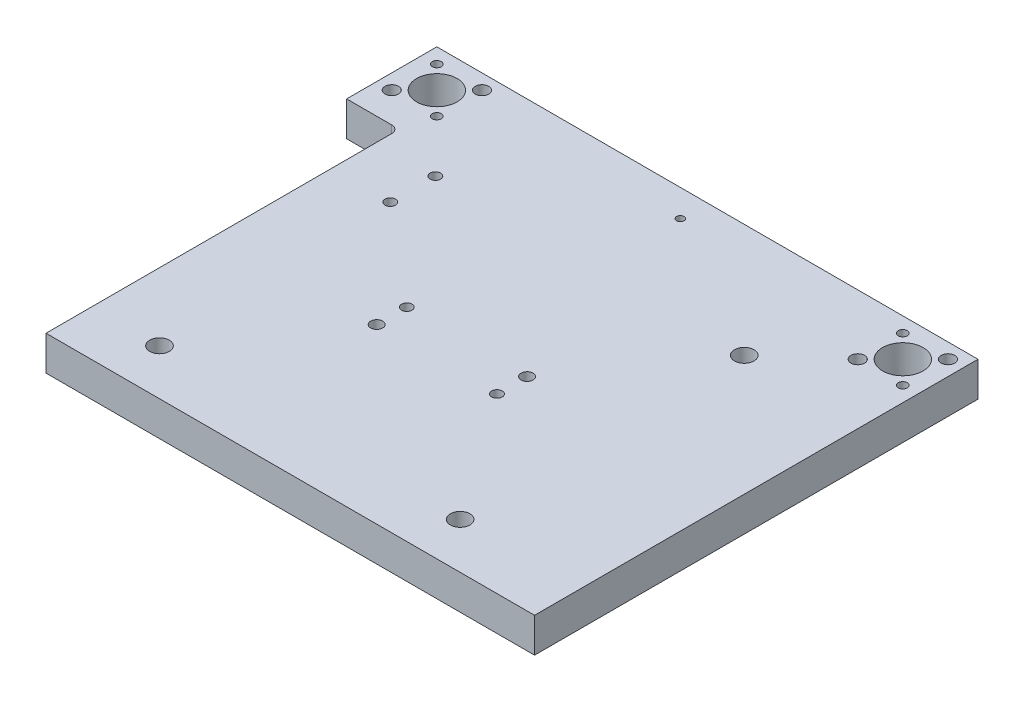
ISO-10303-21;
HEADER;
FILE_DESCRIPTION(('STEP AP214'),'2;1');
FILE_NAME('part.step','',(''),(''),'','','');
FILE_SCHEMA(('AUTOMOTIVE_DESIGN { 1 0 10303 214 1 1 1 1 }'));
ENDSEC;
DATA;
#1=APPLICATION_CONTEXT('core data for automotive mechanical design processes');
#2=APPLICATION_PROTOCOL_DEFINITION('international standard','automotive_design',2000,#1);
#3=PRODUCT_CONTEXT('',#1,'mechanical');
#4=PRODUCT('Part','Part','',(#3));
#5=PRODUCT_RELATED_PRODUCT_CATEGORY('part','',(#4));
#6=PRODUCT_DEFINITION_FORMATION('','',#4);
#7=PRODUCT_DEFINITION_CONTEXT('part definition',#1,'design');
#8=PRODUCT_DEFINITION('design','',#6,#7);
#9=PRODUCT_DEFINITION_SHAPE('','',#8);
#10=(LENGTH_UNIT() NAMED_UNIT(*) SI_UNIT(.MILLI.,.METRE.));
#11=(NAMED_UNIT(*) PLANE_ANGLE_UNIT() SI_UNIT($,.RADIAN.));
#12=(NAMED_UNIT(*) SI_UNIT($,.STERADIAN.) SOLID_ANGLE_UNIT());
#13=UNCERTAINTY_MEASURE_WITH_UNIT(LENGTH_MEASURE(1.E-05),#10,'distance_accuracy_value','');
#14=(GEOMETRIC_REPRESENTATION_CONTEXT(3) GLOBAL_UNCERTAINTY_ASSIGNED_CONTEXT((#13)) GLOBAL_UNIT_ASSIGNED_CONTEXT((#10,
#11,#12)) REPRESENTATION_CONTEXT('',''));
#15=CARTESIAN_POINT('',(0.,0.,0.));
#16=DIRECTION('',(0.,0.,1.));
#17=DIRECTION('',(1.,0.,0.));
#18=AXIS2_PLACEMENT_3D('',#15,#16,#17);
#19=CARTESIAN_POINT('',(-0.000732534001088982,213.58,26.9999931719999));
#20=DIRECTION('',(0.,1.,0.));
#21=DIRECTION('',(0.,0.,1.));
#22=AXIS2_PLACEMENT_3D('',#19,#20,#21);
#23=CYLINDRICAL_SURFACE('',#22,2.5);
#24=CARTESIAN_POINT('',(-0.000732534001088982,230.58,26.9999931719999));
#25=DIRECTION('',(0.,1.,0.));
#26=DIRECTION('',(0.,0.,1.));
#27=AXIS2_PLACEMENT_3D('',#24,#25,#26);
#28=CIRCLE('',#27,2.5);
#29=CARTESIAN_POINT('',(-0.000732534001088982,230.58,29.4999931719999));
#30=VERTEX_POINT('',#29);
#31=EDGE_CURVE('E283',#30,#30,#28,.T.);
#32=ORIENTED_EDGE('',*,*,#31,.T.);
#33=EDGE_LOOP('',(#32));
#34=FACE_BOUND('',#33,.T.);
#35=CARTESIAN_POINT('',(-0.000732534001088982,213.58,26.9999931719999));
#36=DIRECTION('',(0.,1.,0.));
#37=DIRECTION('',(0.,0.,1.));
#38=AXIS2_PLACEMENT_3D('',#35,#36,#37);
#39=CIRCLE('',#38,2.5);
#40=CARTESIAN_POINT('',(-0.000732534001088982,213.58,29.4999931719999));
#41=VERTEX_POINT('',#40);
#42=EDGE_CURVE('E19',#41,#41,#39,.F.);
#43=ORIENTED_EDGE('',*,*,#42,.T.);
#44=EDGE_LOOP('',(#43));
#45=FACE_BOUND('',#44,.T.);
#46=ADVANCED_FACE('F15',(#34,#45),#23,.F.);
#47=CARTESIAN_POINT('',(-0.000732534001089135,213.58,26.9999931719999));
#48=DIRECTION('',(0.,1.,0.));
#49=DIRECTION('',(0.,0.,1.));
#50=AXIS2_PLACEMENT_3D('',#47,#48,#49);
#51=PLANE('',#50);
#52=ORIENTED_EDGE('',*,*,#42,.F.);
#53=EDGE_LOOP('',(#52));
#54=FACE_BOUND('',#53,.T.);
#55=CARTESIAN_POINT('',(-0.00073253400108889,213.58,26.9999931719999));
#56=DIRECTION('',(0.,1.,0.));
#57=DIRECTION('',(0.,0.,1.));
#58=AXIS2_PLACEMENT_3D('',#55,#56,#57);
#59=CIRCLE('',#58,4.);
#60=CARTESIAN_POINT('',(-0.00073253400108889,213.58,30.9999931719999));
#61=VERTEX_POINT('',#60);
#62=EDGE_CURVE('E262',#61,#61,#59,.F.);
#63=ORIENTED_EDGE('',*,*,#62,.T.);
#64=EDGE_LOOP('',(#63));
#65=FACE_BOUND('',#64,.T.);
#66=ADVANCED_FACE('F291',(#54,#65),#51,.F.);
#67=CARTESIAN_POINT('',(-1.12265752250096E-12,230.58,156.5));
#68=DIRECTION('',(0.,-1.,0.));
#69=DIRECTION('',(0.,0.,-1.));
#70=AXIS2_PLACEMENT_3D('',#67,#68,#69);
#71=PLANE('',#70);
#72=CARTESIAN_POINT('',(-100.000000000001,230.58,273.5));
#73=DIRECTION('',(0.,-1.,0.));
#74=DIRECTION('',(0.,0.,-1.));
#75=AXIS2_PLACEMENT_3D('',#72,#73,#74);
#76=CIRCLE('',#75,6.50000000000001);
#77=CARTESIAN_POINT('',(-100.000000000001,230.58,267.));
#78=VERTEX_POINT('',#77);
#79=EDGE_CURVE('E141',#78,#78,#76,.T.);
#80=ORIENTED_EDGE('',*,*,#79,.T.);
#81=EDGE_LOOP('',(#80));
#82=FACE_BOUND('',#81,.T.);
#83=CARTESIAN_POINT('',(99.9999999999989,230.58,273.5));
#84=DIRECTION('',(0.,-1.,0.));
#85=DIRECTION('',(0.,0.,-1.));
#86=AXIS2_PLACEMENT_3D('',#83,#84,#85);
#87=CIRCLE('',#86,6.50000000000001);
#88=CARTESIAN_POINT('',(99.9999999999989,230.58,267.));
#89=VERTEX_POINT('',#88);
#90=EDGE_CURVE('E268',#89,#89,#87,.T.);
#91=ORIENTED_EDGE('',*,*,#90,.T.);
#92=EDGE_LOOP('',(#91));
#93=FACE_BOUND('',#92,.T.);
#94=CARTESIAN_POINT('',(99.9999999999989,230.58,84.5));
#95=DIRECTION('',(0.,-1.,0.));
#96=DIRECTION('',(0.,0.,-1.));
#97=AXIS2_PLACEMENT_3D('',#94,#95,#96);
#98=CIRCLE('',#97,6.50000000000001);
#99=CARTESIAN_POINT('',(99.9999999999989,230.58,78.));
#100=VERTEX_POINT('',#99);
#101=EDGE_CURVE('E265',#100,#100,#98,.T.);
#102=ORIENTED_EDGE('',*,*,#101,.T.);
#103=EDGE_LOOP('',(#102));
#104=FACE_BOUND('',#103,.T.);
#105=ORIENTED_EDGE('',*,*,#31,.F.);
#106=EDGE_LOOP('',(#105));
#107=FACE_BOUND('',#106,.T.);
#108=CARTESIAN_POINT('',(-106.000000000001,230.58,84.));
#109=DIRECTION('',(0.,-1.,0.));
#110=DIRECTION('',(0.,0.,-1.));
#111=AXIS2_PLACEMENT_3D('',#108,#109,#110);
#112=CIRCLE('',#111,3.5);
#113=CARTESIAN_POINT('',(-106.000000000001,230.58,80.5));
#114=VERTEX_POINT('',#113);
#115=EDGE_CURVE('E259',#114,#114,#112,.T.);
#116=ORIENTED_EDGE('',*,*,#115,.T.);
#117=EDGE_LOOP('',(#116));
#118=FACE_BOUND('',#117,.T.);
#119=CARTESIAN_POINT('',(-106.000000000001,230.58,114.));
#120=DIRECTION('',(0.,-1.,0.));
#121=DIRECTION('',(0.,0.,-1.));
#122=AXIS2_PLACEMENT_3D('',#119,#120,#121);
#123=CIRCLE('',#122,3.5);
#124=CARTESIAN_POINT('',(-106.000000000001,230.58,110.5));
#125=VERTEX_POINT('',#124);
#126=EDGE_CURVE('E256',#125,#125,#123,.T.);
#127=ORIENTED_EDGE('',*,*,#126,.T.);
#128=EDGE_LOOP('',(#127));
#129=FACE_BOUND('',#128,.T.);
#130=CARTESIAN_POINT('',(-170.000000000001,230.58,48.9999999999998));
#131=DIRECTION('',(0.,-1.,0.));
#132=DIRECTION('',(0.,0.,-1.));
#133=AXIS2_PLACEMENT_3D('',#130,#131,#132);
#134=CIRCLE('',#133,4.5);
#135=CARTESIAN_POINT('',(-170.000000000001,230.58,44.4999999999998));
#136=VERTEX_POINT('',#135);
#137=EDGE_CURVE('E253',#136,#136,#134,.T.);
#138=ORIENTED_EDGE('',*,*,#137,.T.);
#139=EDGE_LOOP('',(#138));
#140=FACE_BOUND('',#139,.T.);
#141=CARTESIAN_POINT('',(-140.000000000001,230.58,18.9999999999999));
#142=DIRECTION('',(0.,-1.,0.));
#143=DIRECTION('',(0.,0.,-1.));
#144=AXIS2_PLACEMENT_3D('',#141,#142,#143);
#145=CIRCLE('',#144,4.5);
#146=CARTESIAN_POINT('',(-140.000000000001,230.58,14.4999999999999));
#147=VERTEX_POINT('',#146);
#148=EDGE_CURVE('E250',#147,#147,#145,.T.);
#149=ORIENTED_EDGE('',*,*,#148,.T.);
#150=EDGE_LOOP('',(#149));
#151=FACE_BOUND('',#150,.T.);
#152=CARTESIAN_POINT('',(139.999999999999,230.58,49.));
#153=DIRECTION('',(0.,-1.,0.));
#154=DIRECTION('',(0.,0.,-1.));
#155=AXIS2_PLACEMENT_3D('',#152,#153,#154);
#156=CIRCLE('',#155,4.5);
#157=CARTESIAN_POINT('',(139.999999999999,230.58,44.5));
#158=VERTEX_POINT('',#157);
#159=EDGE_CURVE('E247',#158,#158,#156,.T.);
#160=ORIENTED_EDGE('',*,*,#159,.T.);
#161=EDGE_LOOP('',(#160));
#162=FACE_BOUND('',#161,.T.);
#163=CARTESIAN_POINT('',(169.999999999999,230.58,19.));
#164=DIRECTION('',(0.,-1.,0.));
#165=DIRECTION('',(0.,0.,-1.));
#166=AXIS2_PLACEMENT_3D('',#163,#164,#165);
#167=CIRCLE('',#166,4.5);
#168=CARTESIAN_POINT('',(169.999999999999,230.58,14.5));
#169=VERTEX_POINT('',#168);
#170=EDGE_CURVE('E244',#169,#169,#167,.T.);
#171=ORIENTED_EDGE('',*,*,#170,.T.);
#172=EDGE_LOOP('',(#171));
#173=FACE_BOUND('',#172,.T.);
#174=CARTESIAN_POINT('',(-140.000000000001,230.58,48.9999999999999));
#175=DIRECTION('',(0.,-1.,0.));
#176=DIRECTION('',(0.,0.,-1.));
#177=AXIS2_PLACEMENT_3D('',#174,#175,#176);
#178=CIRCLE('',#177,3.);
#179=CARTESIAN_POINT('',(-140.000000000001,230.58,45.9999999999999));
#180=VERTEX_POINT('',#179);
#181=EDGE_CURVE('E241',#180,#180,#178,.T.);
#182=ORIENTED_EDGE('',*,*,#181,.T.);
#183=EDGE_LOOP('',(#182));
#184=FACE_BOUND('',#183,.T.);
#185=CARTESIAN_POINT('',(-170.000000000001,230.58,18.9999999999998));
#186=DIRECTION('',(0.,-1.,0.));
#187=DIRECTION('',(0.,0.,-1.));
#188=AXIS2_PLACEMENT_3D('',#185,#186,#187);
#189=CIRCLE('',#188,3.);
#190=CARTESIAN_POINT('',(-170.000000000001,230.58,15.9999999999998));
#191=VERTEX_POINT('',#190);
#192=EDGE_CURVE('E238',#191,#191,#189,.T.);
#193=ORIENTED_EDGE('',*,*,#192,.T.);
#194=EDGE_LOOP('',(#193));
#195=FACE_BOUND('',#194,.T.);
#196=CARTESIAN_POINT('',(139.999999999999,230.58,19.));
#197=DIRECTION('',(0.,-1.,0.));
#198=DIRECTION('',(0.,0.,-1.));
#199=AXIS2_PLACEMENT_3D('',#196,#197,#198);
#200=CIRCLE('',#199,3.);
#201=CARTESIAN_POINT('',(139.999999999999,230.58,16.));
#202=VERTEX_POINT('',#201);
#203=EDGE_CURVE('E235',#202,#202,#200,.T.);
#204=ORIENTED_EDGE('',*,*,#203,.T.);
#205=EDGE_LOOP('',(#204));
#206=FACE_BOUND('',#205,.T.);
#207=CARTESIAN_POINT('',(169.999999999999,230.58,49.));
#208=DIRECTION('',(0.,-1.,0.));
#209=DIRECTION('',(0.,0.,-1.));
#210=AXIS2_PLACEMENT_3D('',#207,#208,#209);
#211=CIRCLE('',#210,3.);
#212=CARTESIAN_POINT('',(169.999999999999,230.58,46.));
#213=VERTEX_POINT('',#212);
#214=EDGE_CURVE('E232',#213,#213,#211,.T.);
#215=ORIENTED_EDGE('',*,*,#214,.T.);
#216=EDGE_LOOP('',(#215));
#217=FACE_BOUND('',#216,.T.);
#218=CARTESIAN_POINT('',(154.999999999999,230.58,34.));
#219=DIRECTION('',(0.,-1.,0.));
#220=DIRECTION('',(0.,0.,-1.));
#221=AXIS2_PLACEMENT_3D('',#218,#219,#220);
#222=CIRCLE('',#221,13.5);
#223=CARTESIAN_POINT('',(154.999999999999,230.58,20.5));
#224=VERTEX_POINT('',#223);
#225=EDGE_CURVE('E229',#224,#224,#222,.T.);
#226=ORIENTED_EDGE('',*,*,#225,.T.);
#227=EDGE_LOOP('',(#226));
#228=FACE_BOUND('',#227,.T.);
#229=CARTESIAN_POINT('',(-155.000000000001,230.58,33.9999999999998));
#230=DIRECTION('',(0.,-1.,0.));
#231=DIRECTION('',(0.,0.,-1.));
#232=AXIS2_PLACEMENT_3D('',#229,#230,#231);
#233=CIRCLE('',#232,13.5);
#234=CARTESIAN_POINT('',(-155.000000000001,230.58,20.4999999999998));
#235=VERTEX_POINT('',#234);
#236=EDGE_CURVE('E226',#235,#235,#233,.T.);
#237=ORIENTED_EDGE('',*,*,#236,.T.);
#238=EDGE_LOOP('',(#237));
#239=FACE_BOUND('',#238,.T.);
#240=DIRECTION('',(-1.,0.,0.));
#241=VECTOR('',#240,1.);
#242=CARTESIAN_POINT('',(214.999999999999,230.58,9.));
#243=LINE('',#242,#241);
#244=CARTESIAN_POINT('',(-180.000000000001,230.58,8.99999999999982));
#245=VERTEX_POINT('',#244);
#246=CARTESIAN_POINT('',(179.999999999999,230.58,9.));
#247=VERTEX_POINT('',#246);
#248=EDGE_CURVE('E130',#245,#247,#243,.F.);
#249=ORIENTED_EDGE('',*,*,#248,.F.);
#250=DIRECTION('',(0.,0.,1.));
#251=VECTOR('',#250,1.);
#252=CARTESIAN_POINT('',(-180.000000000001,230.58,68.9999999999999));
#253=LINE('',#252,#251);
#254=CARTESIAN_POINT('',(-180.000000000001,230.58,68.9999999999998));
#255=VERTEX_POINT('',#254);
#256=EDGE_CURVE('E117',#245,#255,#253,.T.);
#257=ORIENTED_EDGE('',*,*,#256,.T.);
#258=DIRECTION('',(-1.,0.,0.));
#259=VECTOR('',#258,1.);
#260=CARTESIAN_POINT('',(-150.000000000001,230.58,68.9999999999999));
#261=LINE('',#260,#259);
#262=CARTESIAN_POINT('',(-150.000000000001,230.58,68.9999999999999));
#263=VERTEX_POINT('',#262);
#264=EDGE_CURVE('E72',#255,#263,#261,.F.);
#265=ORIENTED_EDGE('',*,*,#264,.T.);
#266=CARTESIAN_POINT('',(-150.000000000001,230.58,73.9999999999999));
#267=DIRECTION('',(0.,-1.,0.));
#268=DIRECTION('',(0.,0.,-1.));
#269=AXIS2_PLACEMENT_3D('',#266,#267,#268);
#270=CIRCLE('',#269,5.);
#271=CARTESIAN_POINT('',(-145.000000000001,230.58,73.9999999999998));
#272=VERTEX_POINT('',#271);
#273=EDGE_CURVE('E75',#263,#272,#270,.T.);
#274=ORIENTED_EDGE('',*,*,#273,.T.);
#275=DIRECTION('',(0.,0.,1.));
#276=VECTOR('',#275,1.);
#277=CARTESIAN_POINT('',(-145.000000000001,230.58,304.));
#278=LINE('',#277,#276);
#279=CARTESIAN_POINT('',(-145.000000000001,230.58,304.));
#280=VERTEX_POINT('',#279);
#281=EDGE_CURVE('E79',#272,#280,#278,.T.);
#282=ORIENTED_EDGE('',*,*,#281,.T.);
#283=DIRECTION('',(1.,0.,0.));
#284=VECTOR('',#283,1.);
#285=CARTESIAN_POINT('',(-215.000000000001,230.58,304.));
#286=LINE('',#285,#284);
#287=CARTESIAN_POINT('',(179.999999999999,230.58,304.));
#288=VERTEX_POINT('',#287);
#289=EDGE_CURVE('E92',#288,#280,#286,.F.);
#290=ORIENTED_EDGE('',*,*,#289,.F.);
#291=DIRECTION('',(0.,0.,1.));
#292=VECTOR('',#291,1.);
#293=CARTESIAN_POINT('',(179.999999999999,230.58,9.));
#294=LINE('',#293,#292);
#295=EDGE_CURVE('E142',#288,#247,#294,.F.);
#296=ORIENTED_EDGE('',*,*,#295,.T.);
#297=EDGE_LOOP('',(#249,#257,#265,#274,#282,#290,#296));
#298=FACE_BOUND('',#297,.T.);
#299=CARTESIAN_POINT('',(39.9999999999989,230.58,169.));
#300=DIRECTION('',(0.,-1.,0.));
#301=DIRECTION('',(0.,0.,-1.));
#302=AXIS2_PLACEMENT_3D('',#299,#300,#301);
#303=CIRCLE('',#302,4.);
#304=CARTESIAN_POINT('',(39.9999999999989,230.58,165.));
#305=VERTEX_POINT('',#304);
#306=EDGE_CURVE('E150',#305,#305,#303,.T.);
#307=ORIENTED_EDGE('',*,*,#306,.T.);
#308=EDGE_LOOP('',(#307));
#309=FACE_BOUND('',#308,.T.);
#310=CARTESIAN_POINT('',(-40.0000000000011,230.58,189.));
#311=DIRECTION('',(0.,-1.,0.));
#312=DIRECTION('',(0.,0.,-1.));
#313=AXIS2_PLACEMENT_3D('',#310,#311,#312);
#314=CIRCLE('',#313,4.);
#315=CARTESIAN_POINT('',(-40.0000000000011,230.58,185.));
#316=VERTEX_POINT('',#315);
#317=EDGE_CURVE('E275',#316,#316,#314,.T.);
#318=ORIENTED_EDGE('',*,*,#317,.T.);
#319=EDGE_LOOP('',(#318));
#320=FACE_BOUND('',#319,.T.);
#321=CARTESIAN_POINT('',(39.9999999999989,230.58,189.));
#322=DIRECTION('',(0.,-1.,0.));
#323=DIRECTION('',(0.,0.,-1.));
#324=AXIS2_PLACEMENT_3D('',#321,#322,#323);
#325=CIRCLE('',#324,3.5);
#326=CARTESIAN_POINT('',(39.9999999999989,230.58,185.5));
#327=VERTEX_POINT('',#326);
#328=EDGE_CURVE('E278',#327,#327,#325,.T.);
#329=ORIENTED_EDGE('',*,*,#328,.T.);
#330=EDGE_LOOP('',(#329));
#331=FACE_BOUND('',#330,.T.);
#332=CARTESIAN_POINT('',(-40.0000000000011,230.58,169.));
#333=DIRECTION('',(0.,-1.,0.));
#334=DIRECTION('',(0.,0.,-1.));
#335=AXIS2_PLACEMENT_3D('',#332,#333,#334);
#336=CIRCLE('',#335,3.5);
#337=CARTESIAN_POINT('',(-40.0000000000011,230.58,165.5));
#338=VERTEX_POINT('',#337);
#339=EDGE_CURVE('E281',#338,#338,#336,.T.);
#340=ORIENTED_EDGE('',*,*,#339,.T.);
#341=EDGE_LOOP('',(#340));
#342=FACE_BOUND('',#341,.T.);
#343=ADVANCED_FACE('F77',(#82,#93,#104,#107,#118,#129,#140,#151,#162,#173,#184,#195,#206,#217,
#228,#239,#298,#309,#320,#331,#342),#71,.F.);
#344=CARTESIAN_POINT('',(-40.0000000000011,230.58,169.));
#345=DIRECTION('',(0.,-1.,0.));
#346=DIRECTION('',(0.,0.,-1.));
#347=AXIS2_PLACEMENT_3D('',#344,#345,#346);
#348=CYLINDRICAL_SURFACE('',#347,3.5);
#349=CARTESIAN_POINT('',(-40.0000000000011,207.58,169.));
#350=DIRECTION('',(0.,-1.,0.));
#351=DIRECTION('',(0.,0.,-1.));
#352=AXIS2_PLACEMENT_3D('',#349,#350,#351);
#353=CIRCLE('',#352,3.5);
#354=CARTESIAN_POINT('',(-40.0000000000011,207.58,165.5));
#355=VERTEX_POINT('',#354);
#356=EDGE_CURVE('E223',#355,#355,#353,.T.);
#357=ORIENTED_EDGE('',*,*,#356,.T.);
#358=EDGE_LOOP('',(#357));
#359=FACE_BOUND('',#358,.T.);
#360=ORIENTED_EDGE('',*,*,#339,.F.);
#361=EDGE_LOOP('',(#360));
#362=FACE_BOUND('',#361,.T.);
#363=ADVANCED_FACE('F322',(#359,#362),#348,.F.);
#364=CARTESIAN_POINT('',(39.9999999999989,230.58,189.));
#365=DIRECTION('',(0.,-1.,0.));
#366=DIRECTION('',(0.,0.,-1.));
#367=AXIS2_PLACEMENT_3D('',#364,#365,#366);
#368=CYLINDRICAL_SURFACE('',#367,3.5);
#369=CARTESIAN_POINT('',(39.9999999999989,207.58,189.));
#370=DIRECTION('',(0.,-1.,0.));
#371=DIRECTION('',(0.,0.,-1.));
#372=AXIS2_PLACEMENT_3D('',#369,#370,#371);
#373=CIRCLE('',#372,3.5);
#374=CARTESIAN_POINT('',(39.9999999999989,207.58,185.5));
#375=VERTEX_POINT('',#374);
#376=EDGE_CURVE('E220',#375,#375,#373,.T.);
#377=ORIENTED_EDGE('',*,*,#376,.T.);
#378=EDGE_LOOP('',(#377));
#379=FACE_BOUND('',#378,.T.);
#380=ORIENTED_EDGE('',*,*,#328,.F.);
#381=EDGE_LOOP('',(#380));
#382=FACE_BOUND('',#381,.T.);
#383=ADVANCED_FACE('F324',(#379,#382),#368,.F.);
#384=CARTESIAN_POINT('',(-40.0000000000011,230.58,189.));
#385=DIRECTION('',(0.,-1.,0.));
#386=DIRECTION('',(0.,0.,-1.));
#387=AXIS2_PLACEMENT_3D('',#384,#385,#386);
#388=CYLINDRICAL_SURFACE('',#387,4.);
#389=CARTESIAN_POINT('',(-40.0000000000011,207.58,189.));
#390=DIRECTION('',(0.,-1.,0.));
#391=DIRECTION('',(0.,0.,-1.));
#392=AXIS2_PLACEMENT_3D('',#389,#390,#391);
#393=CIRCLE('',#392,4.);
#394=CARTESIAN_POINT('',(-40.0000000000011,207.58,185.));
#395=VERTEX_POINT('',#394);
#396=EDGE_CURVE('E217',#395,#395,#393,.T.);
#397=ORIENTED_EDGE('',*,*,#396,.T.);
#398=EDGE_LOOP('',(#397));
#399=FACE_BOUND('',#398,.T.);
#400=ORIENTED_EDGE('',*,*,#317,.F.);
#401=EDGE_LOOP('',(#400));
#402=FACE_BOUND('',#401,.T.);
#403=ADVANCED_FACE('F334',(#399,#402),#388,.F.);
#404=CARTESIAN_POINT('',(39.9999999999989,230.58,169.));
#405=DIRECTION('',(0.,-1.,0.));
#406=DIRECTION('',(0.,0.,-1.));
#407=AXIS2_PLACEMENT_3D('',#404,#405,#406);
#408=CYLINDRICAL_SURFACE('',#407,4.);
#409=CARTESIAN_POINT('',(39.9999999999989,207.58,169.));
#410=DIRECTION('',(0.,-1.,0.));
#411=DIRECTION('',(0.,0.,-1.));
#412=AXIS2_PLACEMENT_3D('',#409,#410,#411);
#413=CIRCLE('',#412,4.);
#414=CARTESIAN_POINT('',(39.9999999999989,207.58,165.));
#415=VERTEX_POINT('',#414);
#416=EDGE_CURVE('E135',#415,#415,#413,.T.);
#417=ORIENTED_EDGE('',*,*,#416,.T.);
#418=EDGE_LOOP('',(#417));
#419=FACE_BOUND('',#418,.T.);
#420=ORIENTED_EDGE('',*,*,#306,.F.);
#421=EDGE_LOOP('',(#420));
#422=FACE_BOUND('',#421,.T.);
#423=ADVANCED_FACE('F337',(#419,#422),#408,.F.);
#424=CARTESIAN_POINT('',(214.999999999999,230.58,9.));
#425=DIRECTION('',(0.,0.,-1.));
#426=DIRECTION('',(-1.,0.,0.));
#427=AXIS2_PLACEMENT_3D('',#424,#425,#426);
#428=PLANE('',#427);
#429=DIRECTION('',(0.,1.,0.));
#430=VECTOR('',#429,1.);
#431=CARTESIAN_POINT('',(-180.000000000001,230.58,8.99999999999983));
#432=LINE('',#431,#430);
#433=CARTESIAN_POINT('',(-180.000000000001,207.58,8.99999999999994));
#434=VERTEX_POINT('',#433);
#435=EDGE_CURVE('E127',#434,#245,#432,.T.);
#436=ORIENTED_EDGE('',*,*,#435,.T.);
#437=ORIENTED_EDGE('',*,*,#248,.T.);
#438=DIRECTION('',(0.,1.,0.));
#439=VECTOR('',#438,1.);
#440=CARTESIAN_POINT('',(179.999999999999,230.58,9.));
#441=LINE('',#440,#439);
#442=CARTESIAN_POINT('',(179.999999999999,207.58,9.));
#443=VERTEX_POINT('',#442);
#444=EDGE_CURVE('E138',#247,#443,#441,.F.);
#445=ORIENTED_EDGE('',*,*,#444,.T.);
#446=DIRECTION('',(1.,0.,0.));
#447=VECTOR('',#446,1.);
#448=CARTESIAN_POINT('',(-215.000000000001,207.58,9.));
#449=LINE('',#448,#447);
#450=EDGE_CURVE('E124',#443,#434,#449,.F.);
#451=ORIENTED_EDGE('',*,*,#450,.T.);
#452=EDGE_LOOP('',(#436,#437,#445,#451));
#453=FACE_BOUND('',#452,.T.);
#454=ADVANCED_FACE('F340',(#453),#428,.T.);
#455=CARTESIAN_POINT('',(-180.000000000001,230.58,68.9999999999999));
#456=DIRECTION('',(1.,0.,0.));
#457=DIRECTION('',(0.,1.,0.));
#458=AXIS2_PLACEMENT_3D('',#455,#456,#457);
#459=PLANE('',#458);
#460=DIRECTION('',(0.,1.,0.));
#461=VECTOR('',#460,1.);
#462=CARTESIAN_POINT('',(-180.000000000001,230.58,68.9999999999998));
#463=LINE('',#462,#461);
#464=CARTESIAN_POINT('',(-180.000000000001,207.58,68.9999999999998));
#465=VERTEX_POINT('',#464);
#466=EDGE_CURVE('E114',#465,#255,#463,.T.);
#467=ORIENTED_EDGE('',*,*,#466,.T.);
#468=ORIENTED_EDGE('',*,*,#256,.F.);
#469=ORIENTED_EDGE('',*,*,#435,.F.);
#470=DIRECTION('',(0.,0.,1.));
#471=VECTOR('',#470,1.);
#472=CARTESIAN_POINT('',(-180.000000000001,207.58,8.99999999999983));
#473=LINE('',#472,#471);
#474=EDGE_CURVE('E120',#434,#465,#473,.T.);
#475=ORIENTED_EDGE('',*,*,#474,.T.);
#476=EDGE_LOOP('',(#467,#468,#469,#475));
#477=FACE_BOUND('',#476,.T.);
#478=ADVANCED_FACE('F343',(#477),#459,.F.);
#479=CARTESIAN_POINT('',(-150.000000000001,230.58,68.9999999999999));
#480=DIRECTION('',(0.,0.,-1.));
#481=DIRECTION('',(-1.,0.,0.));
#482=AXIS2_PLACEMENT_3D('',#479,#480,#481);
#483=PLANE('',#482);
#484=DIRECTION('',(0.,-1.,0.));
#485=VECTOR('',#484,1.);
#486=CARTESIAN_POINT('',(-150.000000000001,230.58,68.9999999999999));
#487=LINE('',#486,#485);
#488=CARTESIAN_POINT('',(-150.000000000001,207.58,68.9999999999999));
#489=VERTEX_POINT('',#488);
#490=EDGE_CURVE('E85',#489,#263,#487,.F.);
#491=ORIENTED_EDGE('',*,*,#490,.T.);
#492=ORIENTED_EDGE('',*,*,#264,.F.);
#493=ORIENTED_EDGE('',*,*,#466,.F.);
#494=DIRECTION('',(1.,0.,0.));
#495=VECTOR('',#494,1.);
#496=CARTESIAN_POINT('',(-215.000000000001,207.58,68.9999999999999));
#497=LINE('',#496,#495);
#498=EDGE_CURVE('E123',#465,#489,#497,.T.);
#499=ORIENTED_EDGE('',*,*,#498,.T.);
#500=EDGE_LOOP('',(#491,#492,#493,#499));
#501=FACE_BOUND('',#500,.T.);
#502=ADVANCED_FACE('F346',(#501),#483,.F.);
#503=CARTESIAN_POINT('',(-150.000000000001,230.58,73.9999999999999));
#504=DIRECTION('',(0.,-1.,0.));
#505=DIRECTION('',(0.,0.,-1.));
#506=AXIS2_PLACEMENT_3D('',#503,#504,#505);
#507=CYLINDRICAL_SURFACE('',#506,5.);
#508=DIRECTION('',(0.,1.,0.));
#509=VECTOR('',#508,1.);
#510=CARTESIAN_POINT('',(-145.000000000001,230.58,73.9999999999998));
#511=LINE('',#510,#509);
#512=CARTESIAN_POINT('',(-145.000000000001,207.58,73.9999999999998));
#513=VERTEX_POINT('',#512);
#514=EDGE_CURVE('E84',#513,#272,#511,.T.);
#515=ORIENTED_EDGE('',*,*,#514,.T.);
#516=ORIENTED_EDGE('',*,*,#273,.F.);
#517=ORIENTED_EDGE('',*,*,#490,.F.);
#518=CARTESIAN_POINT('',(-150.000000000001,207.58,73.9999999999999));
#519=DIRECTION('',(0.,-1.,0.));
#520=DIRECTION('',(0.,0.,-1.));
#521=AXIS2_PLACEMENT_3D('',#518,#519,#520);
#522=CIRCLE('',#521,5.);
#523=EDGE_CURVE('E97',#489,#513,#522,.T.);
#524=ORIENTED_EDGE('',*,*,#523,.T.);
#525=EDGE_LOOP('',(#515,#516,#517,#524));
#526=FACE_BOUND('',#525,.T.);
#527=ADVANCED_FACE('F95',(#526),#507,.F.);
#528=CARTESIAN_POINT('',(-145.000000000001,230.58,304.));
#529=DIRECTION('',(1.,0.,0.));
#530=DIRECTION('',(0.,1.,0.));
#531=AXIS2_PLACEMENT_3D('',#528,#529,#530);
#532=PLANE('',#531);
#533=DIRECTION('',(0.,-1.,0.));
#534=VECTOR('',#533,1.);
#535=CARTESIAN_POINT('',(-145.000000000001,230.58,304.));
#536=LINE('',#535,#534);
#537=CARTESIAN_POINT('',(-145.000000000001,207.58,304.));
#538=VERTEX_POINT('',#537);
#539=EDGE_CURVE('E91',#280,#538,#536,.T.);
#540=ORIENTED_EDGE('',*,*,#539,.F.);
#541=ORIENTED_EDGE('',*,*,#281,.F.);
#542=ORIENTED_EDGE('',*,*,#514,.F.);
#543=DIRECTION('',(0.,0.,1.));
#544=VECTOR('',#543,1.);
#545=CARTESIAN_POINT('',(-145.000000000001,207.58,8.99999999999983));
#546=LINE('',#545,#544);
#547=EDGE_CURVE('E107',#513,#538,#546,.T.);
#548=ORIENTED_EDGE('',*,*,#547,.T.);
#549=EDGE_LOOP('',(#540,#541,#542,#548));
#550=FACE_BOUND('',#549,.T.);
#551=ADVANCED_FACE('F88',(#550),#532,.F.);
#552=CARTESIAN_POINT('',(-215.000000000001,230.58,304.));
#553=DIRECTION('',(0.,0.,1.));
#554=DIRECTION('',(0.,-1.,0.));
#555=AXIS2_PLACEMENT_3D('',#552,#553,#554);
#556=PLANE('',#555);
#557=ORIENTED_EDGE('',*,*,#539,.T.);
#558=DIRECTION('',(1.,0.,0.));
#559=VECTOR('',#558,1.);
#560=CARTESIAN_POINT('',(-215.000000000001,207.58,304.));
#561=LINE('',#560,#559);
#562=CARTESIAN_POINT('',(179.999999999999,207.58,304.));
#563=VERTEX_POINT('',#562);
#564=EDGE_CURVE('E103',#538,#563,#561,.T.);
#565=ORIENTED_EDGE('',*,*,#564,.T.);
#566=DIRECTION('',(0.,1.,0.));
#567=VECTOR('',#566,1.);
#568=CARTESIAN_POINT('',(179.999999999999,230.58,304.));
#569=LINE('',#568,#567);
#570=EDGE_CURVE('E34',#563,#288,#569,.T.);
#571=ORIENTED_EDGE('',*,*,#570,.T.);
#572=ORIENTED_EDGE('',*,*,#289,.T.);
#573=EDGE_LOOP('',(#557,#565,#571,#572));
#574=FACE_BOUND('',#573,.T.);
#575=ADVANCED_FACE('F352',(#574),#556,.T.);
#576=CARTESIAN_POINT('',(179.999999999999,230.58,9.));
#577=DIRECTION('',(-1.,0.,0.));
#578=DIRECTION('',(0.,0.,1.));
#579=AXIS2_PLACEMENT_3D('',#576,#577,#578);
#580=PLANE('',#579);
#581=ORIENTED_EDGE('',*,*,#444,.F.);
#582=ORIENTED_EDGE('',*,*,#295,.F.);
#583=ORIENTED_EDGE('',*,*,#570,.F.);
#584=DIRECTION('',(0.,0.,1.));
#585=VECTOR('',#584,1.);
#586=CARTESIAN_POINT('',(179.999999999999,207.58,8.99999999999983));
#587=LINE('',#586,#585);
#588=EDGE_CURVE('E106',#563,#443,#587,.F.);
#589=ORIENTED_EDGE('',*,*,#588,.T.);
#590=EDGE_LOOP('',(#581,#582,#583,#589));
#591=FACE_BOUND('',#590,.T.);
#592=ADVANCED_FACE('F354',(#591),#580,.F.);
#593=CARTESIAN_POINT('',(-100.000000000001,230.58,273.5));
#594=DIRECTION('',(0.,-1.,0.));
#595=DIRECTION('',(0.,0.,-1.));
#596=AXIS2_PLACEMENT_3D('',#593,#594,#595);
#597=CYLINDRICAL_SURFACE('',#596,6.50000000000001);
#598=CARTESIAN_POINT('',(-100.000000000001,207.58,273.5));
#599=DIRECTION('',(0.,-1.,0.));
#600=DIRECTION('',(0.,0.,-1.));
#601=AXIS2_PLACEMENT_3D('',#598,#599,#600);
#602=CIRCLE('',#601,6.50000000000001);
#603=CARTESIAN_POINT('',(-100.000000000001,207.58,267.));
#604=VERTEX_POINT('',#603);
#605=EDGE_CURVE('E146',#604,#604,#602,.T.);
#606=ORIENTED_EDGE('',*,*,#605,.T.);
#607=EDGE_LOOP('',(#606));
#608=FACE_BOUND('',#607,.T.);
#609=ORIENTED_EDGE('',*,*,#79,.F.);
#610=EDGE_LOOP('',(#609));
#611=FACE_BOUND('',#610,.T.);
#612=ADVANCED_FACE('F357',(#608,#611),#597,.F.);
#613=CARTESIAN_POINT('',(99.9999999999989,230.58,273.5));
#614=DIRECTION('',(0.,-1.,0.));
#615=DIRECTION('',(0.,0.,-1.));
#616=AXIS2_PLACEMENT_3D('',#613,#614,#615);
#617=CYLINDRICAL_SURFACE('',#616,6.50000000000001);
#618=CARTESIAN_POINT('',(99.9999999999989,207.58,273.5));
#619=DIRECTION('',(0.,-1.,0.));
#620=DIRECTION('',(0.,0.,-1.));
#621=AXIS2_PLACEMENT_3D('',#618,#619,#620);
#622=CIRCLE('',#621,6.50000000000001);
#623=CARTESIAN_POINT('',(99.9999999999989,207.58,267.));
#624=VERTEX_POINT('',#623);
#625=EDGE_CURVE('E209',#624,#624,#622,.T.);
#626=ORIENTED_EDGE('',*,*,#625,.T.);
#627=EDGE_LOOP('',(#626));
#628=FACE_BOUND('',#627,.T.);
#629=ORIENTED_EDGE('',*,*,#90,.F.);
#630=EDGE_LOOP('',(#629));
#631=FACE_BOUND('',#630,.T.);
#632=ADVANCED_FACE('F359',(#628,#631),#617,.F.);
#633=CARTESIAN_POINT('',(99.9999999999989,230.58,84.5));
#634=DIRECTION('',(0.,-1.,0.));
#635=DIRECTION('',(0.,0.,-1.));
#636=AXIS2_PLACEMENT_3D('',#633,#634,#635);
#637=CYLINDRICAL_SURFACE('',#636,6.50000000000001);
#638=CARTESIAN_POINT('',(99.9999999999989,207.58,84.5));
#639=DIRECTION('',(0.,-1.,0.));
#640=DIRECTION('',(0.,0.,-1.));
#641=AXIS2_PLACEMENT_3D('',#638,#639,#640);
#642=CIRCLE('',#641,6.50000000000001);
#643=CARTESIAN_POINT('',(99.9999999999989,207.58,78.));
#644=VERTEX_POINT('',#643);
#645=EDGE_CURVE('E206',#644,#644,#642,.T.);
#646=ORIENTED_EDGE('',*,*,#645,.T.);
#647=EDGE_LOOP('',(#646));
#648=FACE_BOUND('',#647,.T.);
#649=ORIENTED_EDGE('',*,*,#101,.F.);
#650=EDGE_LOOP('',(#649));
#651=FACE_BOUND('',#650,.T.);
#652=ADVANCED_FACE('F299',(#648,#651),#637,.F.);
#653=CARTESIAN_POINT('',(-0.00073253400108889,207.58,26.9999931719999));
#654=DIRECTION('',(0.,1.,0.));
#655=DIRECTION('',(0.,0.,1.));
#656=AXIS2_PLACEMENT_3D('',#653,#654,#655);
#657=CYLINDRICAL_SURFACE('',#656,4.);
#658=ORIENTED_EDGE('',*,*,#62,.F.);
#659=EDGE_LOOP('',(#658));
#660=FACE_BOUND('',#659,.T.);
#661=CARTESIAN_POINT('',(-0.00073253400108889,207.58,26.9999931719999));
#662=DIRECTION('',(0.,1.,0.));
#663=DIRECTION('',(0.,0.,1.));
#664=AXIS2_PLACEMENT_3D('',#661,#662,#663);
#665=CIRCLE('',#664,4.);
#666=CARTESIAN_POINT('',(-0.00073253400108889,207.58,30.9999931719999));
#667=VERTEX_POINT('',#666);
#668=EDGE_CURVE('E203',#667,#667,#665,.F.);
#669=ORIENTED_EDGE('',*,*,#668,.T.);
#670=EDGE_LOOP('',(#669));
#671=FACE_BOUND('',#670,.T.);
#672=ADVANCED_FACE('F296',(#660,#671),#657,.F.);
#673=CARTESIAN_POINT('',(-106.000000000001,230.58,84.));
#674=DIRECTION('',(0.,-1.,0.));
#675=DIRECTION('',(0.,0.,-1.));
#676=AXIS2_PLACEMENT_3D('',#673,#674,#675);
#677=CYLINDRICAL_SURFACE('',#676,3.5);
#678=CARTESIAN_POINT('',(-106.000000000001,207.58,84.));
#679=DIRECTION('',(0.,-1.,0.));
#680=DIRECTION('',(0.,0.,-1.));
#681=AXIS2_PLACEMENT_3D('',#678,#679,#680);
#682=CIRCLE('',#681,3.5);
#683=CARTESIAN_POINT('',(-106.000000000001,207.58,80.5));
#684=VERTEX_POINT('',#683);
#685=EDGE_CURVE('E200',#684,#684,#682,.T.);
#686=ORIENTED_EDGE('',*,*,#685,.T.);
#687=EDGE_LOOP('',(#686));
#688=FACE_BOUND('',#687,.T.);
#689=ORIENTED_EDGE('',*,*,#115,.F.);
#690=EDGE_LOOP('',(#689));
#691=FACE_BOUND('',#690,.T.);
#692=ADVANCED_FACE('F298',(#688,#691),#677,.F.);
#693=CARTESIAN_POINT('',(-106.000000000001,230.58,114.));
#694=DIRECTION('',(0.,-1.,0.));
#695=DIRECTION('',(0.,0.,-1.));
#696=AXIS2_PLACEMENT_3D('',#693,#694,#695);
#697=CYLINDRICAL_SURFACE('',#696,3.5);
#698=CARTESIAN_POINT('',(-106.000000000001,207.58,114.));
#699=DIRECTION('',(0.,-1.,0.));
#700=DIRECTION('',(0.,0.,-1.));
#701=AXIS2_PLACEMENT_3D('',#698,#699,#700);
#702=CIRCLE('',#701,3.5);
#703=CARTESIAN_POINT('',(-106.000000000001,207.58,110.5));
#704=VERTEX_POINT('',#703);
#705=EDGE_CURVE('E197',#704,#704,#702,.T.);
#706=ORIENTED_EDGE('',*,*,#705,.T.);
#707=EDGE_LOOP('',(#706));
#708=FACE_BOUND('',#707,.T.);
#709=ORIENTED_EDGE('',*,*,#126,.F.);
#710=EDGE_LOOP('',(#709));
#711=FACE_BOUND('',#710,.T.);
#712=ADVANCED_FACE('F366',(#708,#711),#697,.F.);
#713=CARTESIAN_POINT('',(-170.000000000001,230.58,48.9999999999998));
#714=DIRECTION('',(0.,-1.,0.));
#715=DIRECTION('',(0.,0.,-1.));
#716=AXIS2_PLACEMENT_3D('',#713,#714,#715);
#717=CYLINDRICAL_SURFACE('',#716,4.5);
#718=CARTESIAN_POINT('',(-170.000000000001,207.58,48.9999999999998));
#719=DIRECTION('',(0.,-1.,0.));
#720=DIRECTION('',(0.,0.,-1.));
#721=AXIS2_PLACEMENT_3D('',#718,#719,#720);
#722=CIRCLE('',#721,4.5);
#723=CARTESIAN_POINT('',(-170.000000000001,207.58,44.4999999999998));
#724=VERTEX_POINT('',#723);
#725=EDGE_CURVE('E194',#724,#724,#722,.T.);
#726=ORIENTED_EDGE('',*,*,#725,.T.);
#727=EDGE_LOOP('',(#726));
#728=FACE_BOUND('',#727,.T.);
#729=ORIENTED_EDGE('',*,*,#137,.F.);
#730=EDGE_LOOP('',(#729));
#731=FACE_BOUND('',#730,.T.);
#732=ADVANCED_FACE('F369',(#728,#731),#717,.F.);
#733=CARTESIAN_POINT('',(-140.000000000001,230.58,18.9999999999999));
#734=DIRECTION('',(0.,-1.,0.));
#735=DIRECTION('',(0.,0.,-1.));
#736=AXIS2_PLACEMENT_3D('',#733,#734,#735);
#737=CYLINDRICAL_SURFACE('',#736,4.5);
#738=CARTESIAN_POINT('',(-140.000000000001,207.58,18.9999999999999));
#739=DIRECTION('',(0.,-1.,0.));
#740=DIRECTION('',(0.,0.,-1.));
#741=AXIS2_PLACEMENT_3D('',#738,#739,#740);
#742=CIRCLE('',#741,4.5);
#743=CARTESIAN_POINT('',(-140.000000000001,207.58,14.4999999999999));
#744=VERTEX_POINT('',#743);
#745=EDGE_CURVE('E191',#744,#744,#742,.T.);
#746=ORIENTED_EDGE('',*,*,#745,.T.);
#747=EDGE_LOOP('',(#746));
#748=FACE_BOUND('',#747,.T.);
#749=ORIENTED_EDGE('',*,*,#148,.F.);
#750=EDGE_LOOP('',(#749));
#751=FACE_BOUND('',#750,.T.);
#752=ADVANCED_FACE('F372',(#748,#751),#737,.F.);
#753=CARTESIAN_POINT('',(139.999999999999,230.58,49.));
#754=DIRECTION('',(0.,-1.,0.));
#755=DIRECTION('',(0.,0.,-1.));
#756=AXIS2_PLACEMENT_3D('',#753,#754,#755);
#757=CYLINDRICAL_SURFACE('',#756,4.5);
#758=CARTESIAN_POINT('',(139.999999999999,207.58,49.));
#759=DIRECTION('',(0.,-1.,0.));
#760=DIRECTION('',(0.,0.,-1.));
#761=AXIS2_PLACEMENT_3D('',#758,#759,#760);
#762=CIRCLE('',#761,4.5);
#763=CARTESIAN_POINT('',(139.999999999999,207.58,44.5));
#764=VERTEX_POINT('',#763);
#765=EDGE_CURVE('E188',#764,#764,#762,.T.);
#766=ORIENTED_EDGE('',*,*,#765,.T.);
#767=EDGE_LOOP('',(#766));
#768=FACE_BOUND('',#767,.T.);
#769=ORIENTED_EDGE('',*,*,#159,.F.);
#770=EDGE_LOOP('',(#769));
#771=FACE_BOUND('',#770,.T.);
#772=ADVANCED_FACE('F375',(#768,#771),#757,.F.);
#773=CARTESIAN_POINT('',(169.999999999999,230.58,19.));
#774=DIRECTION('',(0.,-1.,0.));
#775=DIRECTION('',(0.,0.,-1.));
#776=AXIS2_PLACEMENT_3D('',#773,#774,#775);
#777=CYLINDRICAL_SURFACE('',#776,4.5);
#778=CARTESIAN_POINT('',(169.999999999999,207.58,19.));
#779=DIRECTION('',(0.,-1.,0.));
#780=DIRECTION('',(0.,0.,-1.));
#781=AXIS2_PLACEMENT_3D('',#778,#779,#780);
#782=CIRCLE('',#781,4.5);
#783=CARTESIAN_POINT('',(169.999999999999,207.58,14.5));
#784=VERTEX_POINT('',#783);
#785=EDGE_CURVE('E185',#784,#784,#782,.T.);
#786=ORIENTED_EDGE('',*,*,#785,.T.);
#787=EDGE_LOOP('',(#786));
#788=FACE_BOUND('',#787,.T.);
#789=ORIENTED_EDGE('',*,*,#170,.F.);
#790=EDGE_LOOP('',(#789));
#791=FACE_BOUND('',#790,.T.);
#792=ADVANCED_FACE('F378',(#788,#791),#777,.F.);
#793=CARTESIAN_POINT('',(-140.000000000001,230.58,48.9999999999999));
#794=DIRECTION('',(0.,-1.,0.));
#795=DIRECTION('',(0.,0.,-1.));
#796=AXIS2_PLACEMENT_3D('',#793,#794,#795);
#797=CYLINDRICAL_SURFACE('',#796,3.);
#798=CARTESIAN_POINT('',(-140.000000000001,207.58,48.9999999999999));
#799=DIRECTION('',(0.,-1.,0.));
#800=DIRECTION('',(0.,0.,-1.));
#801=AXIS2_PLACEMENT_3D('',#798,#799,#800);
#802=CIRCLE('',#801,3.);
#803=CARTESIAN_POINT('',(-140.000000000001,207.58,45.9999999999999));
#804=VERTEX_POINT('',#803);
#805=EDGE_CURVE('E182',#804,#804,#802,.T.);
#806=ORIENTED_EDGE('',*,*,#805,.T.);
#807=EDGE_LOOP('',(#806));
#808=FACE_BOUND('',#807,.T.);
#809=ORIENTED_EDGE('',*,*,#181,.F.);
#810=EDGE_LOOP('',(#809));
#811=FACE_BOUND('',#810,.T.);
#812=ADVANCED_FACE('F381',(#808,#811),#797,.F.);
#813=CARTESIAN_POINT('',(-170.000000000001,230.58,18.9999999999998));
#814=DIRECTION('',(0.,-1.,0.));
#815=DIRECTION('',(0.,0.,-1.));
#816=AXIS2_PLACEMENT_3D('',#813,#814,#815);
#817=CYLINDRICAL_SURFACE('',#816,3.);
#818=CARTESIAN_POINT('',(-170.000000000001,207.58,18.9999999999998));
#819=DIRECTION('',(0.,-1.,0.));
#820=DIRECTION('',(0.,0.,-1.));
#821=AXIS2_PLACEMENT_3D('',#818,#819,#820);
#822=CIRCLE('',#821,3.);
#823=CARTESIAN_POINT('',(-170.000000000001,207.58,15.9999999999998));
#824=VERTEX_POINT('',#823);
#825=EDGE_CURVE('E179',#824,#824,#822,.T.);
#826=ORIENTED_EDGE('',*,*,#825,.T.);
#827=EDGE_LOOP('',(#826));
#828=FACE_BOUND('',#827,.T.);
#829=ORIENTED_EDGE('',*,*,#192,.F.);
#830=EDGE_LOOP('',(#829));
#831=FACE_BOUND('',#830,.T.);
#832=ADVANCED_FACE('F384',(#828,#831),#817,.F.);
#833=CARTESIAN_POINT('',(139.999999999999,230.58,19.));
#834=DIRECTION('',(0.,-1.,0.));
#835=DIRECTION('',(0.,0.,-1.));
#836=AXIS2_PLACEMENT_3D('',#833,#834,#835);
#837=CYLINDRICAL_SURFACE('',#836,3.);
#838=CARTESIAN_POINT('',(139.999999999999,207.58,19.));
#839=DIRECTION('',(0.,-1.,0.));
#840=DIRECTION('',(0.,0.,-1.));
#841=AXIS2_PLACEMENT_3D('',#838,#839,#840);
#842=CIRCLE('',#841,3.);
#843=CARTESIAN_POINT('',(139.999999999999,207.58,16.));
#844=VERTEX_POINT('',#843);
#845=EDGE_CURVE('E176',#844,#844,#842,.T.);
#846=ORIENTED_EDGE('',*,*,#845,.T.);
#847=EDGE_LOOP('',(#846));
#848=FACE_BOUND('',#847,.T.);
#849=ORIENTED_EDGE('',*,*,#203,.F.);
#850=EDGE_LOOP('',(#849));
#851=FACE_BOUND('',#850,.T.);
#852=ADVANCED_FACE('F387',(#848,#851),#837,.F.);
#853=CARTESIAN_POINT('',(169.999999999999,230.58,49.));
#854=DIRECTION('',(0.,-1.,0.));
#855=DIRECTION('',(0.,0.,-1.));
#856=AXIS2_PLACEMENT_3D('',#853,#854,#855);
#857=CYLINDRICAL_SURFACE('',#856,3.);
#858=CARTESIAN_POINT('',(169.999999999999,207.58,49.));
#859=DIRECTION('',(0.,-1.,0.));
#860=DIRECTION('',(0.,0.,-1.));
#861=AXIS2_PLACEMENT_3D('',#858,#859,#860);
#862=CIRCLE('',#861,3.);
#863=CARTESIAN_POINT('',(169.999999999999,207.58,46.));
#864=VERTEX_POINT('',#863);
#865=EDGE_CURVE('E173',#864,#864,#862,.T.);
#866=ORIENTED_EDGE('',*,*,#865,.T.);
#867=EDGE_LOOP('',(#866));
#868=FACE_BOUND('',#867,.T.);
#869=ORIENTED_EDGE('',*,*,#214,.F.);
#870=EDGE_LOOP('',(#869));
#871=FACE_BOUND('',#870,.T.);
#872=ADVANCED_FACE('F390',(#868,#871),#857,.F.);
#873=CARTESIAN_POINT('',(154.999999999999,230.58,34.));
#874=DIRECTION('',(0.,-1.,0.));
#875=DIRECTION('',(0.,0.,-1.));
#876=AXIS2_PLACEMENT_3D('',#873,#874,#875);
#877=CYLINDRICAL_SURFACE('',#876,13.5);
#878=CARTESIAN_POINT('',(154.999999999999,207.58,34.));
#879=DIRECTION('',(0.,-1.,0.));
#880=DIRECTION('',(0.,0.,-1.));
#881=AXIS2_PLACEMENT_3D('',#878,#879,#880);
#882=CIRCLE('',#881,13.5);
#883=CARTESIAN_POINT('',(154.999999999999,207.58,20.5));
#884=VERTEX_POINT('',#883);
#885=EDGE_CURVE('E25',#884,#884,#882,.T.);
#886=ORIENTED_EDGE('',*,*,#885,.T.);
#887=EDGE_LOOP('',(#886));
#888=FACE_BOUND('',#887,.T.);
#889=ORIENTED_EDGE('',*,*,#225,.F.);
#890=EDGE_LOOP('',(#889));
#891=FACE_BOUND('',#890,.T.);
#892=ADVANCED_FACE('F393',(#888,#891),#877,.F.);
#893=CARTESIAN_POINT('',(-155.000000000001,230.58,33.9999999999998));
#894=DIRECTION('',(0.,-1.,0.));
#895=DIRECTION('',(0.,0.,-1.));
#896=AXIS2_PLACEMENT_3D('',#893,#894,#895);
#897=CYLINDRICAL_SURFACE('',#896,13.5);
#898=CARTESIAN_POINT('',(-155.000000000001,207.58,33.9999999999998));
#899=DIRECTION('',(0.,-1.,0.));
#900=DIRECTION('',(0.,0.,-1.));
#901=AXIS2_PLACEMENT_3D('',#898,#899,#900);
#902=CIRCLE('',#901,13.5);
#903=CARTESIAN_POINT('',(-155.000000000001,207.58,20.4999999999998));
#904=VERTEX_POINT('',#903);
#905=EDGE_CURVE('E10',#904,#904,#902,.T.);
#906=ORIENTED_EDGE('',*,*,#905,.T.);
#907=EDGE_LOOP('',(#906));
#908=FACE_BOUND('',#907,.T.);
#909=ORIENTED_EDGE('',*,*,#236,.F.);
#910=EDGE_LOOP('',(#909));
#911=FACE_BOUND('',#910,.T.);
#912=ADVANCED_FACE('F304',(#908,#911),#897,.F.);
#913=CARTESIAN_POINT('',(-215.000000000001,207.58,8.99999999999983));
#914=DIRECTION('',(0.,1.,0.));
#915=DIRECTION('',(0.,0.,1.));
#916=AXIS2_PLACEMENT_3D('',#913,#914,#915);
#917=PLANE('',#916);
#918=ORIENTED_EDGE('',*,*,#905,.F.);
#919=EDGE_LOOP('',(#918));
#920=FACE_BOUND('',#919,.T.);
#921=ORIENTED_EDGE('',*,*,#885,.F.);
#922=EDGE_LOOP('',(#921));
#923=FACE_BOUND('',#922,.T.);
#924=ORIENTED_EDGE('',*,*,#865,.F.);
#925=EDGE_LOOP('',(#924));
#926=FACE_BOUND('',#925,.T.);
#927=ORIENTED_EDGE('',*,*,#845,.F.);
#928=EDGE_LOOP('',(#927));
#929=FACE_BOUND('',#928,.T.);
#930=ORIENTED_EDGE('',*,*,#825,.F.);
#931=EDGE_LOOP('',(#930));
#932=FACE_BOUND('',#931,.T.);
#933=ORIENTED_EDGE('',*,*,#805,.F.);
#934=EDGE_LOOP('',(#933));
#935=FACE_BOUND('',#934,.T.);
#936=ORIENTED_EDGE('',*,*,#785,.F.);
#937=EDGE_LOOP('',(#936));
#938=FACE_BOUND('',#937,.T.);
#939=ORIENTED_EDGE('',*,*,#765,.F.);
#940=EDGE_LOOP('',(#939));
#941=FACE_BOUND('',#940,.T.);
#942=ORIENTED_EDGE('',*,*,#745,.F.);
#943=EDGE_LOOP('',(#942));
#944=FACE_BOUND('',#943,.T.);
#945=ORIENTED_EDGE('',*,*,#725,.F.);
#946=EDGE_LOOP('',(#945));
#947=FACE_BOUND('',#946,.T.);
#948=ORIENTED_EDGE('',*,*,#705,.F.);
#949=EDGE_LOOP('',(#948));
#950=FACE_BOUND('',#949,.T.);
#951=ORIENTED_EDGE('',*,*,#685,.F.);
#952=EDGE_LOOP('',(#951));
#953=FACE_BOUND('',#952,.T.);
#954=ORIENTED_EDGE('',*,*,#668,.F.);
#955=EDGE_LOOP('',(#954));
#956=FACE_BOUND('',#955,.T.);
#957=ORIENTED_EDGE('',*,*,#645,.F.);
#958=EDGE_LOOP('',(#957));
#959=FACE_BOUND('',#958,.T.);
#960=ORIENTED_EDGE('',*,*,#625,.F.);
#961=EDGE_LOOP('',(#960));
#962=FACE_BOUND('',#961,.T.);
#963=ORIENTED_EDGE('',*,*,#605,.F.);
#964=EDGE_LOOP('',(#963));
#965=FACE_BOUND('',#964,.T.);
#966=ORIENTED_EDGE('',*,*,#564,.F.);
#967=ORIENTED_EDGE('',*,*,#547,.F.);
#968=ORIENTED_EDGE('',*,*,#523,.F.);
#969=ORIENTED_EDGE('',*,*,#498,.F.);
#970=ORIENTED_EDGE('',*,*,#474,.F.);
#971=ORIENTED_EDGE('',*,*,#450,.F.);
#972=ORIENTED_EDGE('',*,*,#588,.F.);
#973=EDGE_LOOP('',(#966,#967,#968,#969,#970,#971,#972));
#974=FACE_BOUND('',#973,.T.);
#975=ORIENTED_EDGE('',*,*,#416,.F.);
#976=EDGE_LOOP('',(#975));
#977=FACE_BOUND('',#976,.T.);
#978=ORIENTED_EDGE('',*,*,#396,.F.);
#979=EDGE_LOOP('',(#978));
#980=FACE_BOUND('',#979,.T.);
#981=ORIENTED_EDGE('',*,*,#376,.F.);
#982=EDGE_LOOP('',(#981));
#983=FACE_BOUND('',#982,.T.);
#984=ORIENTED_EDGE('',*,*,#356,.F.);
#985=EDGE_LOOP('',(#984));
#986=FACE_BOUND('',#985,.T.);
#987=ADVANCED_FACE('F17',(#920,#923,#926,#929,#932,#935,#938,#941,#944,#947,#950,#953,#956,#959,
#962,#965,#974,#977,#980,#983,#986),#917,.F.);
#988=CLOSED_SHELL('',(#46,#66,#343,#363,#383,#403,#423,#454,#478,#502,#527,#551,#575,#592,#612,
#632,#652,#672,#692,#712,#732,#752,#772,#792,#812,#832,#852,#872,#892,#912,#987));
#989=MANIFOLD_SOLID_BREP('B1',#988);
#990=ADVANCED_BREP_SHAPE_REPRESENTATION('',(#18,#989),#14);
#991=SHAPE_DEFINITION_REPRESENTATION(#9,#990);
ENDSEC;
END-ISO-10303-21;
